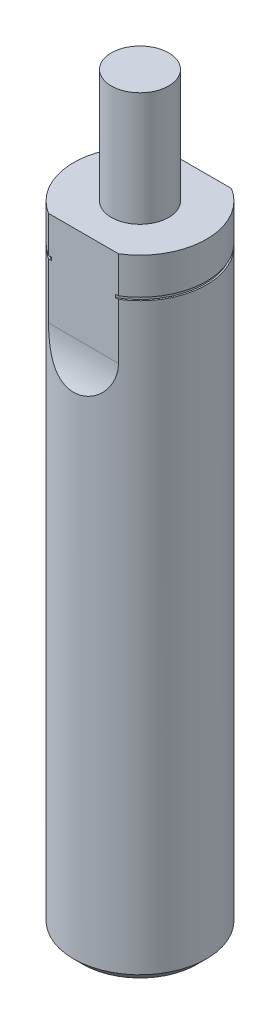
from build123d import *

# Parameters (mm, degrees)
SKETCH1_R               = 5.55625
BOSS_EXTRUDE1_DEPTH     = 52.9082
SKETCH2_R               = 2.39776
BOSS_EXTRUDE2_DEPTH     = 9.525
CUT_EXTRUDE1_DEPTH      = 63.925736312
CUT_EXTRUDE1_DEPTH_BACK = 63.925736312
SKETCH4_W               = 0.127
SKETCH4_H               = 0.254
CHAMFER1_SIZE           = 0.79375


with BuildPart() as part:
    # Sketch1 → Boss-Extrude1 (new body)
    with BuildSketch(Plane(origin=(0, 0, 0), x_dir=(1, 0, 0), z_dir=(0, 1, 0))):
        with Locations(Location((0, 0, 0), (0, 0, 270))):
            Circle(SKETCH1_R)
    extrude(amount=BOSS_EXTRUDE1_DEPTH)

    # Sketch2 → Boss-Extrude2 (add)
    with BuildSketch(Plane(origin=(0, 52.9082, 0), x_dir=(1, 0, 0), z_dir=(0, 1, 0))):
        with Locations(Location((0, 0, 0), (0, 0, 90))):
            Circle(SKETCH2_R)
    extrude(amount=BOSS_EXTRUDE2_DEPTH)

    # Sketch3 → Cut-Extrude1 (cut, two sides: drawn at the far end of the back side and taken through both)
    with BuildSketch(Plane(origin=(0, 0, 0), x_dir=(0, 0, -1), z_dir=(1, 0, 0)).offset(-CUT_EXTRUDE1_DEPTH_BACK)):
        with BuildLine():
            Line((4.7244, 52.9082), (4.7244, 44.9707))
            ThreePointArc((4.7244, 44.9707), (5.345306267, 42.232089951), (7.0866, 40.029045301))
            Line((7.0866, 40.029045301), (7.0866, 52.9082))
            Line((7.0866, 52.9082), (4.7244, 52.9082))
        make_face()
        with BuildLine():
            Line((-7.0866, 40.029045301), (-7.0866, 52.9082))
            Line((-7.0866, 52.9082), (-4.7244, 52.9082))
            Line((-4.7244, 52.9082), (-4.7244, 44.9707))
            ThreePointArc((-4.7244, 44.9707), (-5.345306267, 42.232089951), (-7.0866, 40.029045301))
        make_face()
    extrude(amount=CUT_EXTRUDE1_DEPTH + CUT_EXTRUDE1_DEPTH_BACK, mode=Mode.SUBTRACT)

    # Sketch4 → Cut-Revolve1 (revolve, cut)
    with BuildSketch(Plane.XY, mode=Mode.PRIVATE) as cut_revolve1_sk:
        with Locations((5.49275, 49.7332)):
            Rectangle(SKETCH4_W, SKETCH4_H)
    revolve(cut_revolve1_sk.sketch.rotate(Axis((0, 0, 0), (0, 1, 0)), 58.24275885), axis=Axis((0, 0, 0), (0, 1, 0)), mode=Mode.SUBTRACT)

    # Chamfer1
    chamfer1_edges = [part.edges().sort_by_distance(p)[0] for p in [
        (0, 0, -5.55625),
    ]]
    chamfer(chamfer1_edges, length=CHAMFER1_SIZE)


solid = part.part
